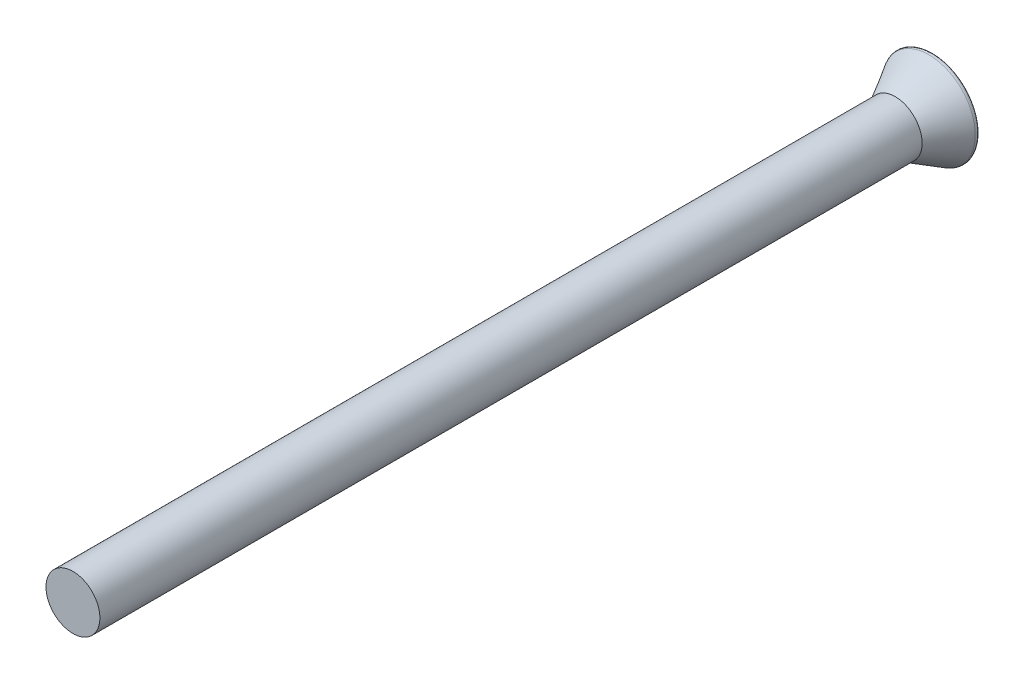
from build123d import *


with BuildPart() as part:
    # Logo3_bib1 → Revolve1 (revolve)
    with BuildSketch(Plane(origin=(0, 0, 0), x_dir=(-1, 0, 0), z_dir=(0, -1, 0))):
        with BuildLine():
            Line((2.055350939, -0.17907), (1.1938, -1.67132))
            Line((1.1938, -1.67132), (1.1938, -38.1))
            Line((1.1938, -38.1), (0, -38.1))
            Line((0, -38.1), (0, 0))
            Line((0, 0), (1.951964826, 0))
            ThreePointArc((1.951964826, 0), (2.055350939, -0.05969), (2.055350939, -0.17907))
        make_face()
    revolve(axis=Axis((0, 0, -16.546754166), (0, 0, 1)))


solid = part.part
